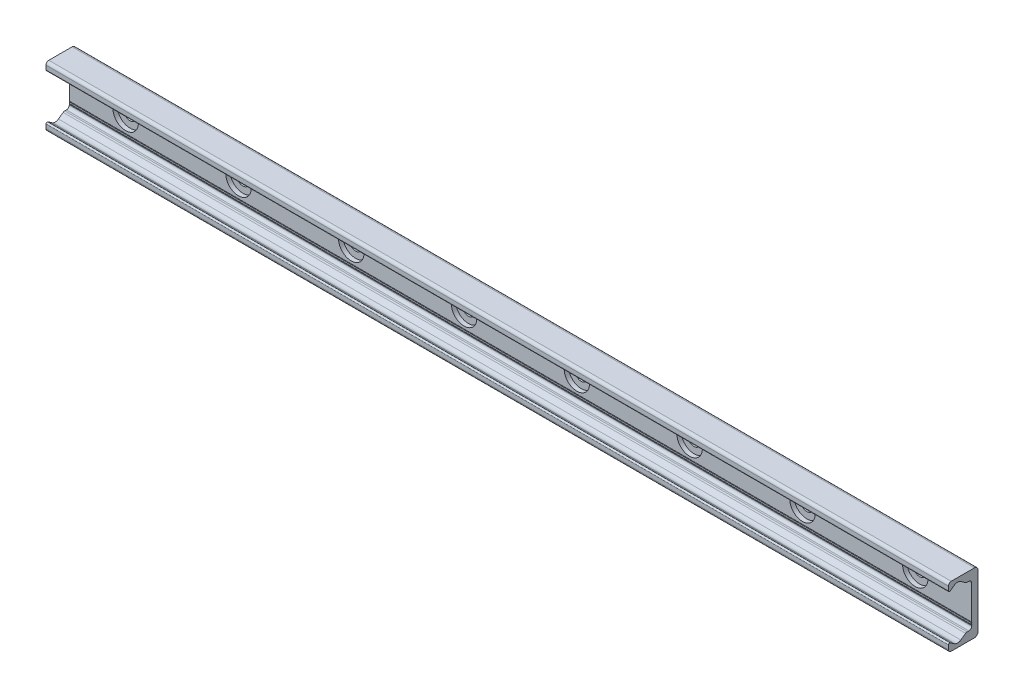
from build123d import *

# Parameters (mm, degrees)
BOSS_EXTRUDE1_DEPTH = 320
SKETCH2_R           = 9
SKETCH2_R_2         = 4.5
CUT_EXTRUDE1_DEPTH  = 3.1
SKETCH2_2_R         = 4.5
CUT_EXTRUDE2_DEPTH  = 322.145605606
LPATTERN1_COUNT     = 8
LPATTERN1_PITCH     = 80


with BuildPart() as part:
    # Sketch1 → Boss-Extrude1 (new, symmetric)
    with BuildSketch(Plane(origin=(0, 0, 0), x_dir=(0, 0, -1), z_dir=(1, 0, 0))):
        with BuildLine():
            Line((0, 0), (0, 19))
            ThreePointArc((0, 19), (-0.732233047, 20.767766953), (-2.5, 21.5))
            Line((-2.5, 21.5), (-19, 21.5))
            ThreePointArc((-19, 21.5), (-20.414213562, 20.914213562), (-21, 19.5))
            Line((-21, 19.5), (-21, 16.625057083))
            ThreePointArc((-21, 16.625057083), (-20.553251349, 15.888838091), (-19.693931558, 15.945160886))
            Line((-19.693931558, 15.945160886), (-16.794305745, 17.975500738))
            ThreePointArc((-16.794305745, 17.975500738), (-14.5, 18.69889256), (-12.205694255, 17.975500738))
            Line((-12.205694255, 17.975500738), (-8.829831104, 15.611695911))
            ThreePointArc((-8.829831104, 15.611695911), (-8.28408983, 15.342566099), (-7.682678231, 15.25))
            Line((-7.682678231, 15.25), (-6.5, 15.25))
            ThreePointArc((-6.5, 15.25), (-5.085786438, 14.664213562), (-4.5, 13.25))
            Line((-4.5, 13.25), (-4.5, -10.75))
            ThreePointArc((-4.5, -10.75), (-4.25, -11), (-4.5, -11.25))
            Line((-4.5, -11.25), (-4.5, -12.25))
            ThreePointArc((-4.5, -12.25), (-4.25, -12.5), (-4.5, -12.75))
            Line((-4.5, -12.75), (-4.5, -13.25))
            ThreePointArc((-4.5, -13.25), (-5.085786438, -14.664213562), (-6.5, -15.25))
            Line((-6.5, -15.25), (-7.682678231, -15.25))
            ThreePointArc((-7.682678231, -15.25), (-8.28408983, -15.342566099), (-8.829831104, -15.611695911))
            Line((-8.829831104, -15.611695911), (-12.205694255, -17.975500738))
            ThreePointArc((-12.205694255, -17.975500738), (-14.5, -18.69889256), (-16.794305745, -17.975500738))
            Line((-16.794305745, -17.975500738), (-19.693931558, -15.945160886))
            ThreePointArc((-19.693931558, -15.945160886), (-20.553251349, -15.888838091), (-21, -16.625057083))
            Line((-21, -16.625057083), (-21, -19.5))
            ThreePointArc((-21, -19.5), (-20.414213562, -20.914213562), (-19, -21.5))
            Line((-19, -21.5), (-2.5, -21.5))
            ThreePointArc((-2.5, -21.5), (-0.732233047, -20.767766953), (0, -19))
            Line((0, -19), (0, 0))
        make_face()
    extrude(amount=BOSS_EXTRUDE1_DEPTH, both=True)

    # Sketch2 → Cut-Extrude1 (cut)
    with BuildSketch(Plane.XY.offset(4.5)):
        with Locations((280, 0)):
            Circle(SKETCH2_R)
        with Locations((280, 0)):
            Circle(SKETCH2_R_2, mode=Mode.SUBTRACT)
    cut_extrude1 = extrude(amount=-CUT_EXTRUDE1_DEPTH, mode=Mode.SUBTRACT)

    # Sketch2_2 → Cut-Extrude2 (cut, through all)
    with BuildSketch(Plane.XY.offset(4.5)):
        with Locations((280, 0)):
            Circle(SKETCH2_2_R)
    cut_extrude2 = extrude(amount=-CUT_EXTRUDE2_DEPTH, mode=Mode.SUBTRACT)

    # LPattern1: Cut-Extrude1, Cut-Extrude2 ×8
    with Locations(*[(-i * LPATTERN1_PITCH, 0, 0) for i in range(1, LPATTERN1_COUNT)]):
        add(cut_extrude1, mode=Mode.SUBTRACT)
        add(cut_extrude2, mode=Mode.SUBTRACT)


solid = part.part
